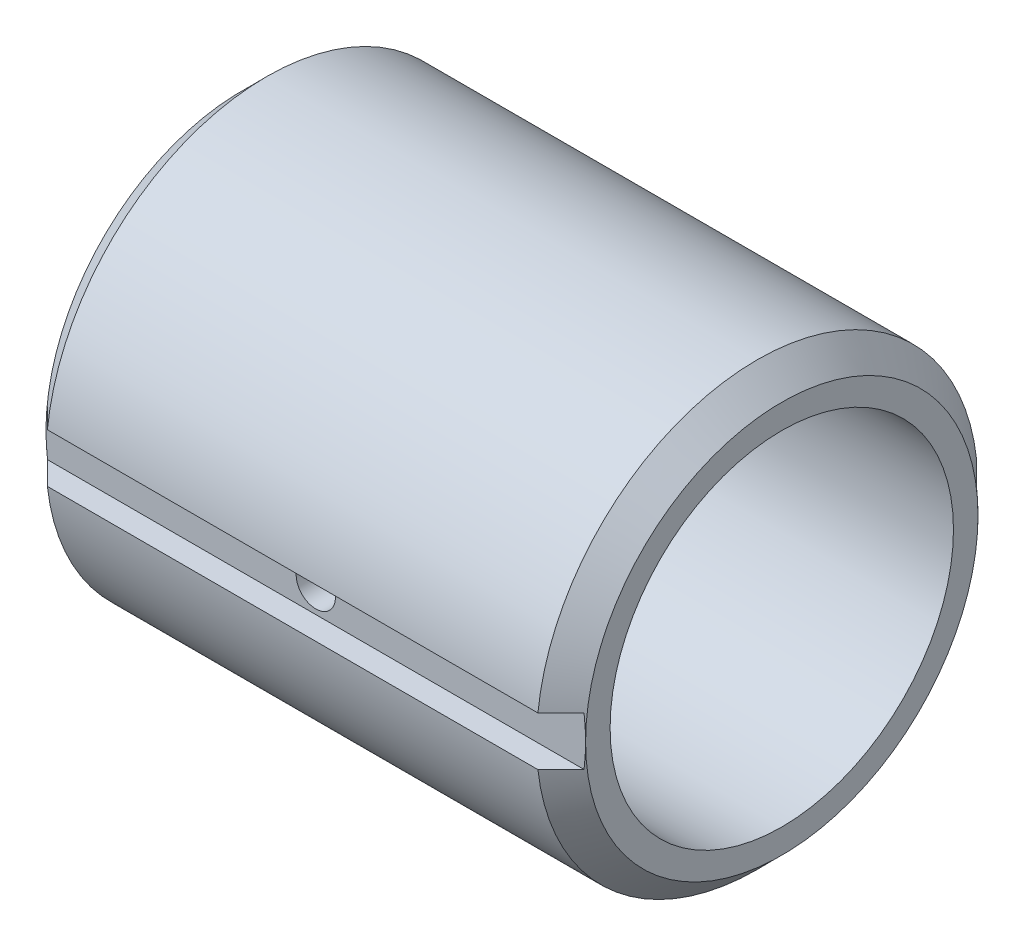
from build123d import *

# Parameters (mm, degrees)
SKETCH2_W          = 12.7
SKETCH2_H          = 12.7
CUT_EXTRUDE1_DEPTH = 152.4
SKETCH4_R          = 44.45
CUT_EXTRUDE2_DEPTH = 152.4
SKETCH5_R          = 5.08
CUT_EXTRUDE3_DEPTH = 152.4


with BuildPart() as part:
    # Sketch1 → Revolve1 (revolve)
    with BuildSketch(Plane.XY):
        Polygon((-63.059464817, -29.018681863), (-63.059464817, 21.781318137), (-56.709464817, 28.131318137), (70.290535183, 28.131318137), (76.640535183, 21.781318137), (76.640535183, -29.018681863), align=None)
    revolve(axis=Axis((76.640535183, -29.018681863, 0), (-1, 0, 0)))

    # Sketch2 → Cut-Extrude1 (cut)
    with BuildSketch(Plane(origin=(76.640535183, 0, 0), x_dir=(0, 0, -1), z_dir=(1, 0, 0))):
        with Locations((-57.15, -29.018681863)):
            Rectangle(SKETCH2_W, SKETCH2_H)
        with Locations((57.15, -29.018681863)):
            Rectangle(SKETCH2_W, SKETCH2_H)
    extrude(amount=-CUT_EXTRUDE1_DEPTH, mode=Mode.SUBTRACT)

    # Sketch4 → Cut-Extrude2 (cut)
    with BuildSketch(Plane(origin=(76.640535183, 0, 0), x_dir=(0, 0, -1), z_dir=(1, 0, 0))):
        with Locations(Location((0, -29.018681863, 0), (0, 0, 90))):
            Circle(SKETCH4_R)
    extrude(amount=-CUT_EXTRUDE2_DEPTH, mode=Mode.SUBTRACT)

    # Sketch5 → Cut-Extrude3 (cut)
    with BuildSketch(Plane(origin=(0, 0, -50.8), x_dir=(-1, 0, 0), z_dir=(0, 0, -1))):
        with Locations((-6.790535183, -29.018681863)):
            Circle(SKETCH5_R)
    extrude(amount=-CUT_EXTRUDE3_DEPTH, mode=Mode.SUBTRACT)


solid = part.part
